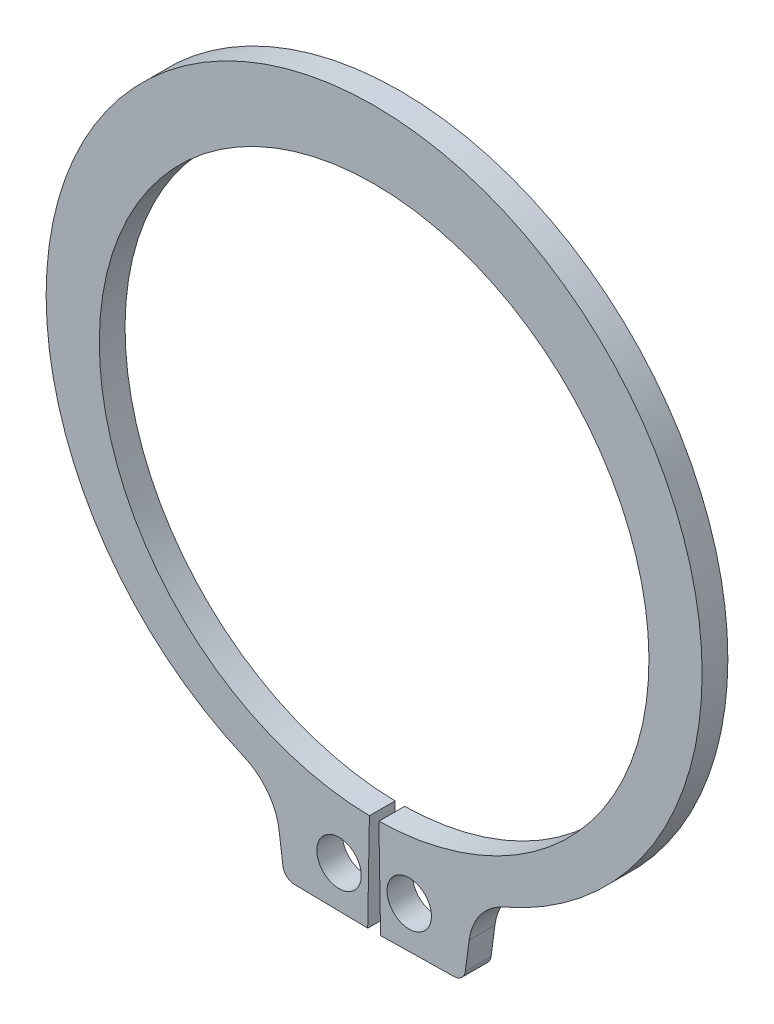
from build123d import *

# Parameters (mm, degrees)
BODYSKE_R  = 0.95
BODY_DEPTH = 1.1


with BuildPart() as part:
    # BodySke → Body (new body)
    with BuildSketch(Plane.XY):
        with BuildLine():
            Line((0.202586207, -11.748253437), (0.275, -15.947629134))
            Line((0.275, -15.947629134), (3.412936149, -15.893518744))
            ThreePointArc((3.412936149, -15.893518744), (3.737216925, -15.766656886), (3.90003789, -15.458856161))
            Line((3.90003789, -15.458856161), (4.063046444, -14.220683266))
            ThreePointArc((4.063046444, -14.220683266), (4.547351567, -13.039514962), (5.551735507, -12.251528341))
            ThreePointArc((5.551735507, -12.251528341), (0, 14.65), (-5.551735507, -12.251528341))
            ThreePointArc((-5.551735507, -12.251528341), (-4.547351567, -13.039514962), (-4.063046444, -14.220683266))
            Line((-4.063046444, -14.220683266), (-3.90003789, -15.458856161))
            ThreePointArc((-3.90003789, -15.458856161), (-3.737216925, -15.766656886), (-3.412936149, -15.893518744))
            Line((-3.412936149, -15.893518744), (-0.275, -15.947629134))
            Line((-0.275, -15.947629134), (-0.202586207, -11.748253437))
            ThreePointArc((-0.202586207, -11.748253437), (0, 11.75), (0.202586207, -11.748253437))
        make_face()
        with Locations((1.5, -14.145692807)):
            Circle(BODYSKE_R, mode=Mode.SUBTRACT)
        with Locations((-1.5, -14.145692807)):
            Circle(BODYSKE_R, mode=Mode.SUBTRACT)
    extrude(amount=-BODY_DEPTH)


solid = part.part
